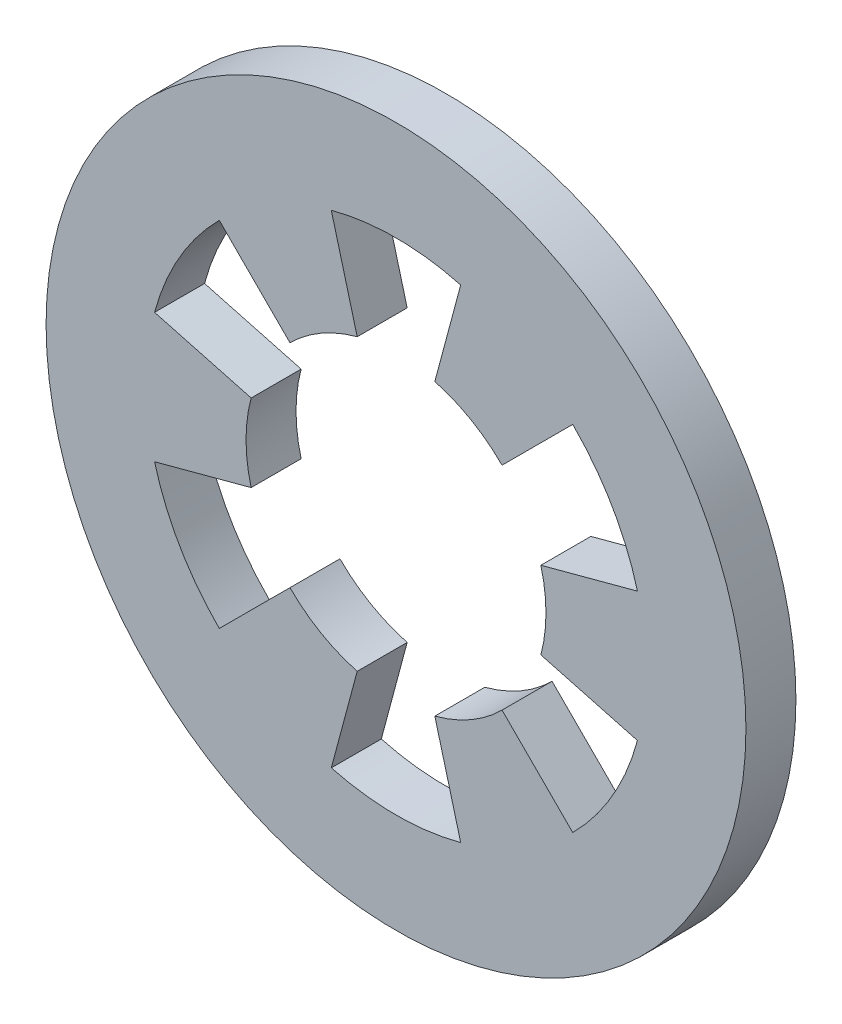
ISO-10303-21;
HEADER;
FILE_DESCRIPTION(('STEP AP214'),'2;1');
FILE_NAME('part.step','',(''),(''),'','','');
FILE_SCHEMA(('AUTOMOTIVE_DESIGN { 1 0 10303 214 1 1 1 1 }'));
ENDSEC;
DATA;
#1=APPLICATION_CONTEXT('core data for automotive mechanical design processes');
#2=APPLICATION_PROTOCOL_DEFINITION('international standard','automotive_design',2000,#1);
#3=PRODUCT_CONTEXT('',#1,'mechanical');
#4=PRODUCT('Part','Part','',(#3));
#5=PRODUCT_RELATED_PRODUCT_CATEGORY('part','',(#4));
#6=PRODUCT_DEFINITION_FORMATION('','',#4);
#7=PRODUCT_DEFINITION_CONTEXT('part definition',#1,'design');
#8=PRODUCT_DEFINITION('design','',#6,#7);
#9=PRODUCT_DEFINITION_SHAPE('','',#8);
#10=(LENGTH_UNIT() NAMED_UNIT(*) SI_UNIT(.MILLI.,.METRE.));
#11=(NAMED_UNIT(*) PLANE_ANGLE_UNIT() SI_UNIT($,.RADIAN.));
#12=(NAMED_UNIT(*) SI_UNIT($,.STERADIAN.) SOLID_ANGLE_UNIT());
#13=UNCERTAINTY_MEASURE_WITH_UNIT(LENGTH_MEASURE(1.E-05),#10,'distance_accuracy_value','');
#14=(GEOMETRIC_REPRESENTATION_CONTEXT(3) GLOBAL_UNCERTAINTY_ASSIGNED_CONTEXT((#13)) GLOBAL_UNIT_ASSIGNED_CONTEXT((#10,
#11,#12)) REPRESENTATION_CONTEXT('',''));
#15=CARTESIAN_POINT('',(0.,0.,0.));
#16=DIRECTION('',(0.,0.,1.));
#17=DIRECTION('',(1.,0.,0.));
#18=AXIS2_PLACEMENT_3D('',#15,#16,#17);
#19=CARTESIAN_POINT('',(0.,0.,0.5));
#20=DIRECTION('',(0.,0.,-1.));
#21=DIRECTION('',(-1.,0.,0.));
#22=AXIS2_PLACEMENT_3D('',#19,#20,#21);
#23=CYLINDRICAL_SURFACE('',#22,1.5);
#24=DIRECTION('',(0.,0.,1.));
#25=VECTOR('',#24,1.);
#26=CARTESIAN_POINT('',(0.3882285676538,1.4488887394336,0.));
#27=LINE('',#26,#25);
#28=CARTESIAN_POINT('',(0.3882285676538,1.4488887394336,0.));
#29=VERTEX_POINT('',#28);
#30=CARTESIAN_POINT('',(0.3882285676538,1.4488887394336,0.5));
#31=VERTEX_POINT('',#30);
#32=EDGE_CURVE('E225',#29,#31,#27,.T.);
#33=ORIENTED_EDGE('',*,*,#32,.F.);
#34=CARTESIAN_POINT('',(0.,0.,0.));
#35=DIRECTION('',(0.,0.,1.));
#36=DIRECTION('',(1.,0.,0.));
#37=AXIS2_PLACEMENT_3D('',#34,#35,#36);
#38=CIRCLE('',#37,1.5);
#39=CARTESIAN_POINT('',(1.06066017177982,1.06066017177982,0.));
#40=VERTEX_POINT('',#39);
#41=EDGE_CURVE('E360',#40,#29,#38,.T.);
#42=ORIENTED_EDGE('',*,*,#41,.F.);
#43=DIRECTION('',(0.,0.,1.));
#44=VECTOR('',#43,1.);
#45=CARTESIAN_POINT('',(1.06066017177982,1.06066017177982,0.));
#46=LINE('',#45,#44);
#47=CARTESIAN_POINT('',(1.06066017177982,1.06066017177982,0.5));
#48=VERTEX_POINT('',#47);
#49=EDGE_CURVE('E356',#40,#48,#46,.T.);
#50=ORIENTED_EDGE('',*,*,#49,.T.);
#51=CARTESIAN_POINT('',(0.,0.,0.5));
#52=DIRECTION('',(0.,0.,1.));
#53=DIRECTION('',(1.,0.,0.));
#54=AXIS2_PLACEMENT_3D('',#51,#52,#53);
#55=CIRCLE('',#54,1.5);
#56=EDGE_CURVE('E365',#48,#31,#55,.T.);
#57=ORIENTED_EDGE('',*,*,#56,.T.);
#58=EDGE_LOOP('',(#33,#42,#50,#57));
#59=FACE_BOUND('',#58,.T.);
#60=ADVANCED_FACE('F30',(#59),#23,.F.);
#61=DIRECTION('',(0.,0.,1.));
#62=VECTOR('',#61,1.);
#63=CARTESIAN_POINT('',(-0.388228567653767,1.44888873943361,0.));
#64=LINE('',#63,#62);
#65=CARTESIAN_POINT('',(-0.388228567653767,1.44888873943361,0.));
#66=VERTEX_POINT('',#65);
#67=CARTESIAN_POINT('',(-0.388228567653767,1.44888873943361,0.5));
#68=VERTEX_POINT('',#67);
#69=EDGE_CURVE('E45',#66,#68,#64,.T.);
#70=ORIENTED_EDGE('',*,*,#69,.T.);
#71=CARTESIAN_POINT('',(-1.06066017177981,1.06066017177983,0.5));
#72=VERTEX_POINT('',#71);
#73=EDGE_CURVE('E213',#68,#72,#55,.T.);
#74=ORIENTED_EDGE('',*,*,#73,.T.);
#75=DIRECTION('',(0.,0.,1.));
#76=VECTOR('',#75,1.);
#77=CARTESIAN_POINT('',(-1.06066017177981,1.06066017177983,0.));
#78=LINE('',#77,#76);
#79=CARTESIAN_POINT('',(-1.06066017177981,1.06066017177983,0.));
#80=VERTEX_POINT('',#79);
#81=EDGE_CURVE('E247',#80,#72,#78,.T.);
#82=ORIENTED_EDGE('',*,*,#81,.F.);
#83=EDGE_CURVE('E364',#66,#80,#38,.T.);
#84=ORIENTED_EDGE('',*,*,#83,.F.);
#85=EDGE_LOOP('',(#70,#74,#82,#84));
#86=FACE_BOUND('',#85,.T.);
#87=ADVANCED_FACE('F412',(#86),#23,.F.);
#88=DIRECTION('',(0.,0.,1.));
#89=VECTOR('',#88,1.);
#90=CARTESIAN_POINT('',(-1.4488887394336,0.388228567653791,0.));
#91=LINE('',#90,#89);
#92=CARTESIAN_POINT('',(-1.4488887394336,0.388228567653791,0.));
#93=VERTEX_POINT('',#92);
#94=CARTESIAN_POINT('',(-1.4488887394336,0.388228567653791,0.5));
#95=VERTEX_POINT('',#94);
#96=EDGE_CURVE('E53',#93,#95,#91,.T.);
#97=ORIENTED_EDGE('',*,*,#96,.T.);
#98=CARTESIAN_POINT('',(-1.44888873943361,-0.388228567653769,0.5));
#99=VERTEX_POINT('',#98);
#100=EDGE_CURVE('E403',#95,#99,#55,.T.);
#101=ORIENTED_EDGE('',*,*,#100,.T.);
#102=DIRECTION('',(0.,0.,1.));
#103=VECTOR('',#102,1.);
#104=CARTESIAN_POINT('',(-1.44888873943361,-0.388228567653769,0.));
#105=LINE('',#104,#103);
#106=CARTESIAN_POINT('',(-1.44888873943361,-0.388228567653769,0.));
#107=VERTEX_POINT('',#106);
#108=EDGE_CURVE('E272',#107,#99,#105,.T.);
#109=ORIENTED_EDGE('',*,*,#108,.F.);
#110=EDGE_CURVE('E422',#93,#107,#38,.T.);
#111=ORIENTED_EDGE('',*,*,#110,.F.);
#112=EDGE_LOOP('',(#97,#101,#109,#111));
#113=FACE_BOUND('',#112,.T.);
#114=ADVANCED_FACE('F450',(#113),#23,.F.);
#115=DIRECTION('',(0.,0.,1.));
#116=VECTOR('',#115,1.);
#117=CARTESIAN_POINT('',(-1.06066017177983,-1.06066017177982,0.));
#118=LINE('',#117,#116);
#119=CARTESIAN_POINT('',(-1.06066017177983,-1.06066017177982,0.));
#120=VERTEX_POINT('',#119);
#121=CARTESIAN_POINT('',(-1.06066017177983,-1.06066017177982,0.5));
#122=VERTEX_POINT('',#121);
#123=EDGE_CURVE('E275',#120,#122,#118,.T.);
#124=ORIENTED_EDGE('',*,*,#123,.T.);
#125=CARTESIAN_POINT('',(-0.38822856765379,-1.4488887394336,0.5));
#126=VERTEX_POINT('',#125);
#127=EDGE_CURVE('E399',#122,#126,#55,.T.);
#128=ORIENTED_EDGE('',*,*,#127,.T.);
#129=DIRECTION('',(0.,0.,1.));
#130=VECTOR('',#129,1.);
#131=CARTESIAN_POINT('',(-0.38822856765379,-1.4488887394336,0.));
#132=LINE('',#131,#130);
#133=CARTESIAN_POINT('',(-0.38822856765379,-1.4488887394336,0.));
#134=VERTEX_POINT('',#133);
#135=EDGE_CURVE('E299',#134,#126,#132,.T.);
#136=ORIENTED_EDGE('',*,*,#135,.F.);
#137=EDGE_CURVE('E423',#120,#134,#38,.T.);
#138=ORIENTED_EDGE('',*,*,#137,.F.);
#139=EDGE_LOOP('',(#124,#128,#136,#138));
#140=FACE_BOUND('',#139,.T.);
#141=ADVANCED_FACE('F445',(#140),#23,.F.);
#142=DIRECTION('',(0.,0.,1.));
#143=VECTOR('',#142,1.);
#144=CARTESIAN_POINT('',(0.388228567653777,-1.4488887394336,0.));
#145=LINE('',#144,#143);
#146=CARTESIAN_POINT('',(0.388228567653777,-1.4488887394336,0.));
#147=VERTEX_POINT('',#146);
#148=CARTESIAN_POINT('',(0.388228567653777,-1.4488887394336,0.5));
#149=VERTEX_POINT('',#148);
#150=EDGE_CURVE('E302',#147,#149,#145,.T.);
#151=ORIENTED_EDGE('',*,*,#150,.T.);
#152=CARTESIAN_POINT('',(1.06066017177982,-1.06066017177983,0.5));
#153=VERTEX_POINT('',#152);
#154=EDGE_CURVE('E398',#149,#153,#55,.T.);
#155=ORIENTED_EDGE('',*,*,#154,.T.);
#156=DIRECTION('',(0.,0.,1.));
#157=VECTOR('',#156,1.);
#158=CARTESIAN_POINT('',(1.06066017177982,-1.06066017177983,0.));
#159=LINE('',#158,#157);
#160=CARTESIAN_POINT('',(1.06066017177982,-1.06066017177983,0.));
#161=VERTEX_POINT('',#160);
#162=EDGE_CURVE('E326',#161,#153,#159,.T.);
#163=ORIENTED_EDGE('',*,*,#162,.F.);
#164=EDGE_CURVE('E426',#147,#161,#38,.T.);
#165=ORIENTED_EDGE('',*,*,#164,.F.);
#166=EDGE_LOOP('',(#151,#155,#163,#165));
#167=FACE_BOUND('',#166,.T.);
#168=ADVANCED_FACE('F436',(#167),#23,.F.);
#169=CARTESIAN_POINT('',(0.,0.,0.5));
#170=DIRECTION('',(0.,0.,1.));
#171=DIRECTION('',(1.,0.,0.));
#172=AXIS2_PLACEMENT_3D('',#169,#170,#171);
#173=PLANE('',#172);
#174=DIRECTION('',(0.258819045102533,0.965925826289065,0.));
#175=VECTOR('',#174,1.);
#176=CARTESIAN_POINT('',(0.3882285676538,1.4488887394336,0.5));
#177=LINE('',#176,#175);
#178=CARTESIAN_POINT('',(0.647047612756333,2.41481456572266,0.5));
#179=VERTEX_POINT('',#178);
#180=EDGE_CURVE('E214',#31,#179,#177,.T.);
#181=ORIENTED_EDGE('',*,*,#180,.F.);
#182=ORIENTED_EDGE('',*,*,#56,.F.);
#183=DIRECTION('',(-0.707106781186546,-0.707106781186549,0.));
#184=VECTOR('',#183,1.);
#185=CARTESIAN_POINT('',(1.06066017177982,1.06066017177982,0.5));
#186=LINE('',#185,#184);
#187=CARTESIAN_POINT('',(1.76776695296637,1.76776695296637,0.5));
#188=VERTEX_POINT('',#187);
#189=EDGE_CURVE('E335',#188,#48,#186,.T.);
#190=ORIENTED_EDGE('',*,*,#189,.F.);
#191=CARTESIAN_POINT('',(0.,0.,0.5));
#192=DIRECTION('',(0.,0.,1.));
#193=DIRECTION('',(1.,0.,0.));
#194=AXIS2_PLACEMENT_3D('',#191,#192,#193);
#195=CIRCLE('',#194,2.5);
#196=CARTESIAN_POINT('',(2.41481456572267,0.647047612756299,0.5));
#197=VERTEX_POINT('',#196);
#198=EDGE_CURVE('E325',#197,#188,#195,.T.);
#199=ORIENTED_EDGE('',*,*,#198,.F.);
#200=DIRECTION('',(0.965925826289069,0.25881904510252,0.));
#201=VECTOR('',#200,1.);
#202=CARTESIAN_POINT('',(1.4488887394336,0.388228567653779,0.5));
#203=LINE('',#202,#201);
#204=CARTESIAN_POINT('',(1.4488887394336,0.388228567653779,0.5));
#205=VERTEX_POINT('',#204);
#206=EDGE_CURVE('E337',#205,#197,#203,.T.);
#207=ORIENTED_EDGE('',*,*,#206,.F.);
#208=CARTESIAN_POINT('',(1.4488887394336,-0.388228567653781,0.5));
#209=VERTEX_POINT('',#208);
#210=EDGE_CURVE('E363',#209,#205,#55,.T.);
#211=ORIENTED_EDGE('',*,*,#210,.F.);
#212=DIRECTION('',(-0.965925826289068,0.258819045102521,0.));
#213=VECTOR('',#212,1.);
#214=CARTESIAN_POINT('',(1.4488887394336,-0.388228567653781,0.5));
#215=LINE('',#214,#213);
#216=CARTESIAN_POINT('',(2.41481456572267,-0.647047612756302,0.5));
#217=VERTEX_POINT('',#216);
#218=EDGE_CURVE('E308',#217,#209,#215,.T.);
#219=ORIENTED_EDGE('',*,*,#218,.F.);
#220=CARTESIAN_POINT('',(0.,0.,0.5));
#221=DIRECTION('',(0.,0.,1.));
#222=DIRECTION('',(0.499999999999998,-0.86602540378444,0.));
#223=AXIS2_PLACEMENT_3D('',#220,#221,#222);
#224=CIRCLE('',#223,2.5);
#225=CARTESIAN_POINT('',(1.76776695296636,-1.76776695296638,0.5));
#226=VERTEX_POINT('',#225);
#227=EDGE_CURVE('E298',#226,#217,#224,.T.);
#228=ORIENTED_EDGE('',*,*,#227,.F.);
#229=DIRECTION('',(0.707106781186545,-0.70710678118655,0.));
#230=VECTOR('',#229,1.);
#231=CARTESIAN_POINT('',(1.06066017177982,-1.06066017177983,0.5));
#232=LINE('',#231,#230);
#233=EDGE_CURVE('E310',#153,#226,#232,.T.);
#234=ORIENTED_EDGE('',*,*,#233,.F.);
#235=ORIENTED_EDGE('',*,*,#154,.F.);
#236=DIRECTION('',(-0.258819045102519,0.965925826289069,0.));
#237=VECTOR('',#236,1.);
#238=CARTESIAN_POINT('',(0.388228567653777,-1.4488887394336,0.5));
#239=LINE('',#238,#237);
#240=CARTESIAN_POINT('',(0.647047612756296,-2.41481456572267,0.5));
#241=VERTEX_POINT('',#240);
#242=EDGE_CURVE('E281',#241,#149,#239,.T.);
#243=ORIENTED_EDGE('',*,*,#242,.F.);
#244=CARTESIAN_POINT('',(0.,0.,0.5));
#245=DIRECTION('',(0.,0.,1.));
#246=DIRECTION('',(-0.500000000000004,-0.866025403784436,0.));
#247=AXIS2_PLACEMENT_3D('',#244,#245,#246);
#248=CIRCLE('',#247,2.5);
#249=CARTESIAN_POINT('',(-0.647047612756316,-2.41481456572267,0.5));
#250=VERTEX_POINT('',#249);
#251=EDGE_CURVE('E271',#250,#241,#248,.T.);
#252=ORIENTED_EDGE('',*,*,#251,.F.);
#253=DIRECTION('',(-0.258819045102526,-0.965925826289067,0.));
#254=VECTOR('',#253,1.);
#255=CARTESIAN_POINT('',(-0.38822856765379,-1.4488887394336,0.5));
#256=LINE('',#255,#254);
#257=EDGE_CURVE('E283',#126,#250,#256,.T.);
#258=ORIENTED_EDGE('',*,*,#257,.F.);
#259=ORIENTED_EDGE('',*,*,#127,.F.);
#260=DIRECTION('',(0.707106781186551,0.707106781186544,0.));
#261=VECTOR('',#260,1.);
#262=CARTESIAN_POINT('',(-1.06066017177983,-1.06066017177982,0.5));
#263=LINE('',#262,#261);
#264=CARTESIAN_POINT('',(-1.76776695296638,-1.76776695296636,0.5));
#265=VERTEX_POINT('',#264);
#266=EDGE_CURVE('E254',#265,#122,#263,.T.);
#267=ORIENTED_EDGE('',*,*,#266,.F.);
#268=CARTESIAN_POINT('',(0.,0.,0.5));
#269=DIRECTION('',(0.,0.,1.));
#270=DIRECTION('',(-1.,0.,0.));
#271=AXIS2_PLACEMENT_3D('',#268,#269,#270);
#272=CIRCLE('',#271,2.5);
#273=CARTESIAN_POINT('',(-2.41481456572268,-0.647047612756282,0.5));
#274=VERTEX_POINT('',#273);
#275=EDGE_CURVE('E246',#274,#265,#272,.T.);
#276=ORIENTED_EDGE('',*,*,#275,.F.);
#277=DIRECTION('',(-0.96592582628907,-0.258819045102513,0.));
#278=VECTOR('',#277,1.);
#279=CARTESIAN_POINT('',(-1.44888873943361,-0.388228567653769,0.5));
#280=LINE('',#279,#278);
#281=EDGE_CURVE('E256',#99,#274,#280,.T.);
#282=ORIENTED_EDGE('',*,*,#281,.F.);
#283=ORIENTED_EDGE('',*,*,#100,.F.);
#284=DIRECTION('',(0.965925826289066,-0.258819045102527,0.));
#285=VECTOR('',#284,1.);
#286=CARTESIAN_POINT('',(-1.4488887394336,0.388228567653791,0.5));
#287=LINE('',#286,#285);
#288=CARTESIAN_POINT('',(-2.41481456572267,0.647047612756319,0.5));
#289=VERTEX_POINT('',#288);
#290=EDGE_CURVE('E230',#289,#95,#287,.T.);
#291=ORIENTED_EDGE('',*,*,#290,.F.);
#292=CARTESIAN_POINT('',(0.,0.,0.5));
#293=DIRECTION('',(0.,0.,1.));
#294=DIRECTION('',(-0.499999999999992,0.866025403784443,0.));
#295=AXIS2_PLACEMENT_3D('',#292,#293,#294);
#296=CIRCLE('',#295,2.5);
#297=CARTESIAN_POINT('',(-1.76776695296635,1.76776695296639,0.5));
#298=VERTEX_POINT('',#297);
#299=EDGE_CURVE('E224',#298,#289,#296,.T.);
#300=ORIENTED_EDGE('',*,*,#299,.F.);
#301=DIRECTION('',(-0.70710678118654,0.707106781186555,0.));
#302=VECTOR('',#301,1.);
#303=CARTESIAN_POINT('',(-1.06066017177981,1.06066017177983,0.5));
#304=LINE('',#303,#302);
#305=EDGE_CURVE('E232',#72,#298,#304,.T.);
#306=ORIENTED_EDGE('',*,*,#305,.F.);
#307=ORIENTED_EDGE('',*,*,#73,.F.);
#308=DIRECTION('',(0.258819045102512,-0.965925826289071,0.));
#309=VECTOR('',#308,1.);
#310=CARTESIAN_POINT('',(-0.388228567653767,1.44888873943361,0.5));
#311=LINE('',#310,#309);
#312=CARTESIAN_POINT('',(-0.647047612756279,2.41481456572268,0.5));
#313=VERTEX_POINT('',#312);
#314=EDGE_CURVE('E194',#313,#68,#311,.T.);
#315=ORIENTED_EDGE('',*,*,#314,.F.);
#316=CARTESIAN_POINT('',(0.,0.,0.5));
#317=DIRECTION('',(0.,0.,1.));
#318=DIRECTION('',(0.50000000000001,0.866025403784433,0.));
#319=AXIS2_PLACEMENT_3D('',#316,#317,#318);
#320=CIRCLE('',#319,2.5);
#321=EDGE_CURVE('E202',#179,#313,#320,.T.);
#322=ORIENTED_EDGE('',*,*,#321,.F.);
#323=EDGE_LOOP('',(#181,#182,#190,#199,#207,#211,#219,#228,#234,#235,#243,#252,#258,#259,#267,
#276,#282,#283,#291,#300,#306,#307,#315,#322));
#324=FACE_BOUND('',#323,.T.);
#325=CARTESIAN_POINT('',(0.,0.,0.5));
#326=DIRECTION('',(0.,0.,1.));
#327=DIRECTION('',(1.,0.,0.));
#328=AXIS2_PLACEMENT_3D('',#325,#326,#327);
#329=CIRCLE('',#328,3.5);
#330=CARTESIAN_POINT('',(3.5,0.,0.5));
#331=VERTEX_POINT('',#330);
#332=EDGE_CURVE('E11',#331,#331,#329,.T.);
#333=ORIENTED_EDGE('',*,*,#332,.T.);
#334=EDGE_LOOP('',(#333));
#335=FACE_BOUND('',#334,.T.);
#336=ADVANCED_FACE('F210',(#324,#335),#173,.T.);
#337=CARTESIAN_POINT('',(0.,0.,0.));
#338=DIRECTION('',(0.,0.,1.));
#339=DIRECTION('',(1.,0.,0.));
#340=AXIS2_PLACEMENT_3D('',#337,#338,#339);
#341=PLANE('',#340);
#342=CARTESIAN_POINT('',(0.,0.,0.));
#343=DIRECTION('',(0.,0.,1.));
#344=DIRECTION('',(1.,0.,0.));
#345=AXIS2_PLACEMENT_3D('',#342,#343,#344);
#346=CIRCLE('',#345,3.5);
#347=CARTESIAN_POINT('',(3.5,0.,0.));
#348=VERTEX_POINT('',#347);
#349=EDGE_CURVE('E38',#348,#348,#346,.T.);
#350=ORIENTED_EDGE('',*,*,#349,.F.);
#351=EDGE_LOOP('',(#350));
#352=FACE_BOUND('',#351,.T.);
#353=ORIENTED_EDGE('',*,*,#41,.T.);
#354=DIRECTION('',(0.258819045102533,0.965925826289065,0.));
#355=VECTOR('',#354,1.);
#356=CARTESIAN_POINT('',(0.3882285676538,1.4488887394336,0.));
#357=LINE('',#356,#355);
#358=CARTESIAN_POINT('',(0.647047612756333,2.41481456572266,0.));
#359=VERTEX_POINT('',#358);
#360=EDGE_CURVE('E199',#29,#359,#357,.T.);
#361=ORIENTED_EDGE('',*,*,#360,.T.);
#362=CARTESIAN_POINT('',(0.,0.,0.));
#363=DIRECTION('',(0.,0.,1.));
#364=DIRECTION('',(0.50000000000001,0.866025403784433,0.));
#365=AXIS2_PLACEMENT_3D('',#362,#363,#364);
#366=CIRCLE('',#365,2.5);
#367=CARTESIAN_POINT('',(-0.647047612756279,2.41481456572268,0.));
#368=VERTEX_POINT('',#367);
#369=EDGE_CURVE('E216',#359,#368,#366,.T.);
#370=ORIENTED_EDGE('',*,*,#369,.T.);
#371=DIRECTION('',(0.258819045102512,-0.965925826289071,0.));
#372=VECTOR('',#371,1.);
#373=CARTESIAN_POINT('',(-0.388228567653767,1.44888873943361,0.));
#374=LINE('',#373,#372);
#375=EDGE_CURVE('E195',#368,#66,#374,.T.);
#376=ORIENTED_EDGE('',*,*,#375,.T.);
#377=ORIENTED_EDGE('',*,*,#83,.T.);
#378=DIRECTION('',(-0.70710678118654,0.707106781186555,0.));
#379=VECTOR('',#378,1.);
#380=CARTESIAN_POINT('',(-1.06066017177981,1.06066017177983,0.));
#381=LINE('',#380,#379);
#382=CARTESIAN_POINT('',(-1.76776695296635,1.76776695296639,0.));
#383=VERTEX_POINT('',#382);
#384=EDGE_CURVE('E240',#80,#383,#381,.T.);
#385=ORIENTED_EDGE('',*,*,#384,.T.);
#386=CARTESIAN_POINT('',(0.,0.,0.));
#387=DIRECTION('',(0.,0.,1.));
#388=DIRECTION('',(-0.499999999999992,0.866025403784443,0.));
#389=AXIS2_PLACEMENT_3D('',#386,#387,#388);
#390=CIRCLE('',#389,2.5);
#391=CARTESIAN_POINT('',(-2.41481456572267,0.647047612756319,0.));
#392=VERTEX_POINT('',#391);
#393=EDGE_CURVE('E235',#383,#392,#390,.T.);
#394=ORIENTED_EDGE('',*,*,#393,.T.);
#395=DIRECTION('',(0.965925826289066,-0.258819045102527,0.));
#396=VECTOR('',#395,1.);
#397=CARTESIAN_POINT('',(-1.4488887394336,0.388228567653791,0.));
#398=LINE('',#397,#396);
#399=EDGE_CURVE('E238',#392,#93,#398,.T.);
#400=ORIENTED_EDGE('',*,*,#399,.T.);
#401=ORIENTED_EDGE('',*,*,#110,.T.);
#402=DIRECTION('',(-0.96592582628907,-0.258819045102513,0.));
#403=VECTOR('',#402,1.);
#404=CARTESIAN_POINT('',(-1.44888873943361,-0.388228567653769,0.));
#405=LINE('',#404,#403);
#406=CARTESIAN_POINT('',(-2.41481456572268,-0.647047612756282,0.));
#407=VERTEX_POINT('',#406);
#408=EDGE_CURVE('E265',#107,#407,#405,.T.);
#409=ORIENTED_EDGE('',*,*,#408,.T.);
#410=CARTESIAN_POINT('',(0.,0.,0.));
#411=DIRECTION('',(0.,0.,1.));
#412=DIRECTION('',(-1.,0.,0.));
#413=AXIS2_PLACEMENT_3D('',#410,#411,#412);
#414=CIRCLE('',#413,2.5);
#415=CARTESIAN_POINT('',(-1.76776695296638,-1.76776695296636,0.));
#416=VERTEX_POINT('',#415);
#417=EDGE_CURVE('E259',#407,#416,#414,.T.);
#418=ORIENTED_EDGE('',*,*,#417,.T.);
#419=DIRECTION('',(0.707106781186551,0.707106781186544,0.));
#420=VECTOR('',#419,1.);
#421=CARTESIAN_POINT('',(-1.06066017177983,-1.06066017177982,0.));
#422=LINE('',#421,#420);
#423=EDGE_CURVE('E262',#416,#120,#422,.T.);
#424=ORIENTED_EDGE('',*,*,#423,.T.);
#425=ORIENTED_EDGE('',*,*,#137,.T.);
#426=DIRECTION('',(-0.258819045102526,-0.965925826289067,0.));
#427=VECTOR('',#426,1.);
#428=CARTESIAN_POINT('',(-0.38822856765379,-1.4488887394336,0.));
#429=LINE('',#428,#427);
#430=CARTESIAN_POINT('',(-0.647047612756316,-2.41481456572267,0.));
#431=VERTEX_POINT('',#430);
#432=EDGE_CURVE('E292',#134,#431,#429,.T.);
#433=ORIENTED_EDGE('',*,*,#432,.T.);
#434=CARTESIAN_POINT('',(0.,0.,0.));
#435=DIRECTION('',(0.,0.,1.));
#436=DIRECTION('',(-0.500000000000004,-0.866025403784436,0.));
#437=AXIS2_PLACEMENT_3D('',#434,#435,#436);
#438=CIRCLE('',#437,2.5);
#439=CARTESIAN_POINT('',(0.647047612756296,-2.41481456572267,0.));
#440=VERTEX_POINT('',#439);
#441=EDGE_CURVE('E286',#431,#440,#438,.T.);
#442=ORIENTED_EDGE('',*,*,#441,.T.);
#443=DIRECTION('',(-0.258819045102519,0.965925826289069,0.));
#444=VECTOR('',#443,1.);
#445=CARTESIAN_POINT('',(0.388228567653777,-1.4488887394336,0.));
#446=LINE('',#445,#444);
#447=EDGE_CURVE('E289',#440,#147,#446,.T.);
#448=ORIENTED_EDGE('',*,*,#447,.T.);
#449=ORIENTED_EDGE('',*,*,#164,.T.);
#450=DIRECTION('',(0.707106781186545,-0.70710678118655,0.));
#451=VECTOR('',#450,1.);
#452=CARTESIAN_POINT('',(1.06066017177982,-1.06066017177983,0.));
#453=LINE('',#452,#451);
#454=CARTESIAN_POINT('',(1.76776695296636,-1.76776695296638,0.));
#455=VERTEX_POINT('',#454);
#456=EDGE_CURVE('E319',#161,#455,#453,.T.);
#457=ORIENTED_EDGE('',*,*,#456,.T.);
#458=CARTESIAN_POINT('',(0.,0.,0.));
#459=DIRECTION('',(0.,0.,1.));
#460=DIRECTION('',(0.499999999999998,-0.86602540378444,0.));
#461=AXIS2_PLACEMENT_3D('',#458,#459,#460);
#462=CIRCLE('',#461,2.5);
#463=CARTESIAN_POINT('',(2.41481456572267,-0.647047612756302,0.));
#464=VERTEX_POINT('',#463);
#465=EDGE_CURVE('E313',#455,#464,#462,.T.);
#466=ORIENTED_EDGE('',*,*,#465,.T.);
#467=DIRECTION('',(-0.965925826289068,0.258819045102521,0.));
#468=VECTOR('',#467,1.);
#469=CARTESIAN_POINT('',(1.4488887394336,-0.388228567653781,0.));
#470=LINE('',#469,#468);
#471=CARTESIAN_POINT('',(1.4488887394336,-0.388228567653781,0.));
#472=VERTEX_POINT('',#471);
#473=EDGE_CURVE('E316',#464,#472,#470,.T.);
#474=ORIENTED_EDGE('',*,*,#473,.T.);
#475=CARTESIAN_POINT('',(1.4488887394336,0.388228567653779,0.));
#476=VERTEX_POINT('',#475);
#477=EDGE_CURVE('E352',#472,#476,#38,.T.);
#478=ORIENTED_EDGE('',*,*,#477,.T.);
#479=DIRECTION('',(0.965925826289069,0.25881904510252,0.));
#480=VECTOR('',#479,1.);
#481=CARTESIAN_POINT('',(1.4488887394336,0.388228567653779,0.));
#482=LINE('',#481,#480);
#483=CARTESIAN_POINT('',(2.41481456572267,0.647047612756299,0.));
#484=VERTEX_POINT('',#483);
#485=EDGE_CURVE('E346',#476,#484,#482,.T.);
#486=ORIENTED_EDGE('',*,*,#485,.T.);
#487=CARTESIAN_POINT('',(0.,0.,0.));
#488=DIRECTION('',(0.,0.,1.));
#489=DIRECTION('',(1.,0.,0.));
#490=AXIS2_PLACEMENT_3D('',#487,#488,#489);
#491=CIRCLE('',#490,2.5);
#492=CARTESIAN_POINT('',(1.76776695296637,1.76776695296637,0.));
#493=VERTEX_POINT('',#492);
#494=EDGE_CURVE('E340',#484,#493,#491,.T.);
#495=ORIENTED_EDGE('',*,*,#494,.T.);
#496=DIRECTION('',(-0.707106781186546,-0.707106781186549,0.));
#497=VECTOR('',#496,1.);
#498=CARTESIAN_POINT('',(1.06066017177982,1.06066017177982,0.));
#499=LINE('',#498,#497);
#500=EDGE_CURVE('E343',#493,#40,#499,.T.);
#501=ORIENTED_EDGE('',*,*,#500,.T.);
#502=EDGE_LOOP('',(#353,#361,#370,#376,#377,#385,#394,#400,#401,#409,#418,#424,#425,#433,#442,
#448,#449,#457,#466,#474,#478,#486,#495,#501));
#503=FACE_BOUND('',#502,.T.);
#504=ADVANCED_FACE('F371',(#352,#503),#341,.F.);
#505=CARTESIAN_POINT('',(0.,0.,0.5));
#506=DIRECTION('',(0.,0.,-1.));
#507=DIRECTION('',(-1.,0.,0.));
#508=AXIS2_PLACEMENT_3D('',#505,#506,#507);
#509=CYLINDRICAL_SURFACE('',#508,3.5);
#510=ORIENTED_EDGE('',*,*,#332,.F.);
#511=EDGE_LOOP('',(#510));
#512=FACE_BOUND('',#511,.T.);
#513=ORIENTED_EDGE('',*,*,#349,.T.);
#514=EDGE_LOOP('',(#513));
#515=FACE_BOUND('',#514,.T.);
#516=ADVANCED_FACE('F32',(#512,#515),#509,.T.);
#517=DIRECTION('',(0.,0.,1.));
#518=VECTOR('',#517,1.);
#519=CARTESIAN_POINT('',(1.4488887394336,-0.388228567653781,0.));
#520=LINE('',#519,#518);
#521=EDGE_CURVE('E329',#472,#209,#520,.T.);
#522=ORIENTED_EDGE('',*,*,#521,.T.);
#523=ORIENTED_EDGE('',*,*,#210,.T.);
#524=DIRECTION('',(0.,0.,1.));
#525=VECTOR('',#524,1.);
#526=CARTESIAN_POINT('',(1.4488887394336,0.388228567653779,0.));
#527=LINE('',#526,#525);
#528=EDGE_CURVE('E353',#476,#205,#527,.T.);
#529=ORIENTED_EDGE('',*,*,#528,.F.);
#530=ORIENTED_EDGE('',*,*,#477,.F.);
#531=EDGE_LOOP('',(#522,#523,#529,#530));
#532=FACE_BOUND('',#531,.T.);
#533=ADVANCED_FACE('F433',(#532),#23,.F.);
#534=CARTESIAN_POINT('',(0.,0.,0.));
#535=DIRECTION('',(0.,0.,1.));
#536=DIRECTION('',(1.,0.,0.));
#537=AXIS2_PLACEMENT_3D('',#534,#535,#536);
#538=CYLINDRICAL_SURFACE('',#537,2.5);
#539=ORIENTED_EDGE('',*,*,#198,.T.);
#540=DIRECTION('',(0.,0.,1.));
#541=VECTOR('',#540,1.);
#542=CARTESIAN_POINT('',(1.76776695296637,1.76776695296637,0.));
#543=LINE('',#542,#541);
#544=EDGE_CURVE('E349',#493,#188,#543,.T.);
#545=ORIENTED_EDGE('',*,*,#544,.F.);
#546=ORIENTED_EDGE('',*,*,#494,.F.);
#547=DIRECTION('',(0.,0.,1.));
#548=VECTOR('',#547,1.);
#549=CARTESIAN_POINT('',(2.41481456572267,0.647047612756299,0.));
#550=LINE('',#549,#548);
#551=EDGE_CURVE('E350',#484,#197,#550,.T.);
#552=ORIENTED_EDGE('',*,*,#551,.T.);
#553=EDGE_LOOP('',(#539,#545,#546,#552));
#554=FACE_BOUND('',#553,.T.);
#555=ADVANCED_FACE('F389',(#554),#538,.F.);
#556=CARTESIAN_POINT('',(1.4488887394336,0.388228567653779,0.));
#557=DIRECTION('',(0.25881904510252,-0.965925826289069,0.));
#558=DIRECTION('',(0.965925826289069,0.25881904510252,0.));
#559=AXIS2_PLACEMENT_3D('',#556,#557,#558);
#560=PLANE('',#559);
#561=ORIENTED_EDGE('',*,*,#206,.T.);
#562=ORIENTED_EDGE('',*,*,#551,.F.);
#563=ORIENTED_EDGE('',*,*,#485,.F.);
#564=ORIENTED_EDGE('',*,*,#528,.T.);
#565=EDGE_LOOP('',(#561,#562,#563,#564));
#566=FACE_BOUND('',#565,.T.);
#567=ADVANCED_FACE('F392',(#566),#560,.F.);
#568=CARTESIAN_POINT('',(1.06066017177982,1.06066017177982,0.));
#569=DIRECTION('',(-0.707106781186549,0.707106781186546,0.));
#570=DIRECTION('',(-0.707106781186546,-0.707106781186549,0.));
#571=AXIS2_PLACEMENT_3D('',#568,#569,#570);
#572=PLANE('',#571);
#573=ORIENTED_EDGE('',*,*,#189,.T.);
#574=ORIENTED_EDGE('',*,*,#49,.F.);
#575=ORIENTED_EDGE('',*,*,#500,.F.);
#576=ORIENTED_EDGE('',*,*,#544,.T.);
#577=EDGE_LOOP('',(#573,#574,#575,#576));
#578=FACE_BOUND('',#577,.T.);
#579=ADVANCED_FACE('F386',(#578),#572,.F.);
#580=CARTESIAN_POINT('',(0.,0.,0.));
#581=DIRECTION('',(0.,0.,1.));
#582=DIRECTION('',(1.,0.,0.));
#583=AXIS2_PLACEMENT_3D('',#580,#581,#582);
#584=CYLINDRICAL_SURFACE('',#583,2.5);
#585=ORIENTED_EDGE('',*,*,#227,.T.);
#586=DIRECTION('',(0.,0.,1.));
#587=VECTOR('',#586,1.);
#588=CARTESIAN_POINT('',(2.41481456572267,-0.647047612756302,0.));
#589=LINE('',#588,#587);
#590=EDGE_CURVE('E322',#464,#217,#589,.T.);
#591=ORIENTED_EDGE('',*,*,#590,.F.);
#592=ORIENTED_EDGE('',*,*,#465,.F.);
#593=DIRECTION('',(0.,0.,1.));
#594=VECTOR('',#593,1.);
#595=CARTESIAN_POINT('',(1.76776695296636,-1.76776695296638,0.));
#596=LINE('',#595,#594);
#597=EDGE_CURVE('E323',#455,#226,#596,.T.);
#598=ORIENTED_EDGE('',*,*,#597,.T.);
#599=EDGE_LOOP('',(#585,#591,#592,#598));
#600=FACE_BOUND('',#599,.T.);
#601=ADVANCED_FACE('F460',(#600),#584,.F.);
#602=CARTESIAN_POINT('',(1.06066017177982,-1.06066017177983,0.));
#603=DIRECTION('',(-0.70710678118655,-0.707106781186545,0.));
#604=DIRECTION('',(0.707106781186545,-0.70710678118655,0.));
#605=AXIS2_PLACEMENT_3D('',#602,#603,#604);
#606=PLANE('',#605);
#607=ORIENTED_EDGE('',*,*,#233,.T.);
#608=ORIENTED_EDGE('',*,*,#597,.F.);
#609=ORIENTED_EDGE('',*,*,#456,.F.);
#610=ORIENTED_EDGE('',*,*,#162,.T.);
#611=EDGE_LOOP('',(#607,#608,#609,#610));
#612=FACE_BOUND('',#611,.T.);
#613=ADVANCED_FACE('F457',(#612),#606,.F.);
#614=CARTESIAN_POINT('',(1.4488887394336,-0.388228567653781,0.));
#615=DIRECTION('',(0.258819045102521,0.965925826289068,0.));
#616=DIRECTION('',(-0.965925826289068,0.258819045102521,0.));
#617=AXIS2_PLACEMENT_3D('',#614,#615,#616);
#618=PLANE('',#617);
#619=ORIENTED_EDGE('',*,*,#218,.T.);
#620=ORIENTED_EDGE('',*,*,#521,.F.);
#621=ORIENTED_EDGE('',*,*,#473,.F.);
#622=ORIENTED_EDGE('',*,*,#590,.T.);
#623=EDGE_LOOP('',(#619,#620,#621,#622));
#624=FACE_BOUND('',#623,.T.);
#625=ADVANCED_FACE('F462',(#624),#618,.F.);
#626=CARTESIAN_POINT('',(0.,0.,0.));
#627=DIRECTION('',(0.,0.,1.));
#628=DIRECTION('',(1.,0.,0.));
#629=AXIS2_PLACEMENT_3D('',#626,#627,#628);
#630=CYLINDRICAL_SURFACE('',#629,2.5);
#631=ORIENTED_EDGE('',*,*,#251,.T.);
#632=DIRECTION('',(0.,0.,1.));
#633=VECTOR('',#632,1.);
#634=CARTESIAN_POINT('',(0.647047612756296,-2.41481456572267,0.));
#635=LINE('',#634,#633);
#636=EDGE_CURVE('E295',#440,#241,#635,.T.);
#637=ORIENTED_EDGE('',*,*,#636,.F.);
#638=ORIENTED_EDGE('',*,*,#441,.F.);
#639=DIRECTION('',(0.,0.,1.));
#640=VECTOR('',#639,1.);
#641=CARTESIAN_POINT('',(-0.647047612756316,-2.41481456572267,0.));
#642=LINE('',#641,#640);
#643=EDGE_CURVE('E296',#431,#250,#642,.T.);
#644=ORIENTED_EDGE('',*,*,#643,.T.);
#645=EDGE_LOOP('',(#631,#637,#638,#644));
#646=FACE_BOUND('',#645,.T.);
#647=ADVANCED_FACE('F464',(#646),#630,.F.);
#648=CARTESIAN_POINT('',(-0.38822856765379,-1.4488887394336,0.));
#649=DIRECTION('',(-0.965925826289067,0.258819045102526,0.));
#650=DIRECTION('',(-0.258819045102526,-0.965925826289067,0.));
#651=AXIS2_PLACEMENT_3D('',#648,#649,#650);
#652=PLANE('',#651);
#653=ORIENTED_EDGE('',*,*,#257,.T.);
#654=ORIENTED_EDGE('',*,*,#643,.F.);
#655=ORIENTED_EDGE('',*,*,#432,.F.);
#656=ORIENTED_EDGE('',*,*,#135,.T.);
#657=EDGE_LOOP('',(#653,#654,#655,#656));
#658=FACE_BOUND('',#657,.T.);
#659=ADVANCED_FACE('F470',(#658),#652,.F.);
#660=CARTESIAN_POINT('',(0.388228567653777,-1.4488887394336,0.));
#661=DIRECTION('',(0.965925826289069,0.258819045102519,0.));
#662=DIRECTION('',(-0.258819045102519,0.965925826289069,0.));
#663=AXIS2_PLACEMENT_3D('',#660,#661,#662);
#664=PLANE('',#663);
#665=ORIENTED_EDGE('',*,*,#242,.T.);
#666=ORIENTED_EDGE('',*,*,#150,.F.);
#667=ORIENTED_EDGE('',*,*,#447,.F.);
#668=ORIENTED_EDGE('',*,*,#636,.T.);
#669=EDGE_LOOP('',(#665,#666,#667,#668));
#670=FACE_BOUND('',#669,.T.);
#671=ADVANCED_FACE('F511',(#670),#664,.F.);
#672=CARTESIAN_POINT('',(0.,0.,0.));
#673=DIRECTION('',(0.,0.,1.));
#674=DIRECTION('',(1.,0.,0.));
#675=AXIS2_PLACEMENT_3D('',#672,#673,#674);
#676=CYLINDRICAL_SURFACE('',#675,2.5);
#677=ORIENTED_EDGE('',*,*,#275,.T.);
#678=DIRECTION('',(0.,0.,1.));
#679=VECTOR('',#678,1.);
#680=CARTESIAN_POINT('',(-1.76776695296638,-1.76776695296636,0.));
#681=LINE('',#680,#679);
#682=EDGE_CURVE('E268',#416,#265,#681,.T.);
#683=ORIENTED_EDGE('',*,*,#682,.F.);
#684=ORIENTED_EDGE('',*,*,#417,.F.);
#685=DIRECTION('',(0.,0.,1.));
#686=VECTOR('',#685,1.);
#687=CARTESIAN_POINT('',(-2.41481456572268,-0.647047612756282,0.));
#688=LINE('',#687,#686);
#689=EDGE_CURVE('E269',#407,#274,#688,.T.);
#690=ORIENTED_EDGE('',*,*,#689,.T.);
#691=EDGE_LOOP('',(#677,#683,#684,#690));
#692=FACE_BOUND('',#691,.T.);
#693=ADVANCED_FACE('F521',(#692),#676,.F.);
#694=CARTESIAN_POINT('',(-1.44888873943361,-0.388228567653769,0.));
#695=DIRECTION('',(-0.258819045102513,0.965925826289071,0.));
#696=DIRECTION('',(-0.965925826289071,-0.258819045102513,0.));
#697=AXIS2_PLACEMENT_3D('',#694,#695,#696);
#698=PLANE('',#697);
#699=ORIENTED_EDGE('',*,*,#281,.T.);
#700=ORIENTED_EDGE('',*,*,#689,.F.);
#701=ORIENTED_EDGE('',*,*,#408,.F.);
#702=ORIENTED_EDGE('',*,*,#108,.T.);
#703=EDGE_LOOP('',(#699,#700,#701,#702));
#704=FACE_BOUND('',#703,.T.);
#705=ADVANCED_FACE('F530',(#704),#698,.F.);
#706=CARTESIAN_POINT('',(-1.06066017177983,-1.06066017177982,0.));
#707=DIRECTION('',(0.707106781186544,-0.707106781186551,0.));
#708=DIRECTION('',(0.707106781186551,0.707106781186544,0.));
#709=AXIS2_PLACEMENT_3D('',#706,#707,#708);
#710=PLANE('',#709);
#711=ORIENTED_EDGE('',*,*,#266,.T.);
#712=ORIENTED_EDGE('',*,*,#123,.F.);
#713=ORIENTED_EDGE('',*,*,#423,.F.);
#714=ORIENTED_EDGE('',*,*,#682,.T.);
#715=EDGE_LOOP('',(#711,#712,#713,#714));
#716=FACE_BOUND('',#715,.T.);
#717=ADVANCED_FACE('F540',(#716),#710,.F.);
#718=CARTESIAN_POINT('',(0.,0.,0.));
#719=DIRECTION('',(0.,0.,1.));
#720=DIRECTION('',(1.,0.,0.));
#721=AXIS2_PLACEMENT_3D('',#718,#719,#720);
#722=CYLINDRICAL_SURFACE('',#721,2.5);
#723=ORIENTED_EDGE('',*,*,#299,.T.);
#724=DIRECTION('',(0.,0.,1.));
#725=VECTOR('',#724,1.);
#726=CARTESIAN_POINT('',(-2.41481456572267,0.647047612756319,0.));
#727=LINE('',#726,#725);
#728=EDGE_CURVE('E243',#392,#289,#727,.T.);
#729=ORIENTED_EDGE('',*,*,#728,.F.);
#730=ORIENTED_EDGE('',*,*,#393,.F.);
#731=DIRECTION('',(0.,0.,1.));
#732=VECTOR('',#731,1.);
#733=CARTESIAN_POINT('',(-1.76776695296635,1.76776695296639,0.));
#734=LINE('',#733,#732);
#735=EDGE_CURVE('E244',#383,#298,#734,.T.);
#736=ORIENTED_EDGE('',*,*,#735,.T.);
#737=EDGE_LOOP('',(#723,#729,#730,#736));
#738=FACE_BOUND('',#737,.T.);
#739=ADVANCED_FACE('F420',(#738),#722,.F.);
#740=CARTESIAN_POINT('',(-1.06066017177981,1.06066017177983,0.));
#741=DIRECTION('',(0.707106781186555,0.70710678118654,0.));
#742=DIRECTION('',(-0.70710678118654,0.707106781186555,0.));
#743=AXIS2_PLACEMENT_3D('',#740,#741,#742);
#744=PLANE('',#743);
#745=ORIENTED_EDGE('',*,*,#305,.T.);
#746=ORIENTED_EDGE('',*,*,#735,.F.);
#747=ORIENTED_EDGE('',*,*,#384,.F.);
#748=ORIENTED_EDGE('',*,*,#81,.T.);
#749=EDGE_LOOP('',(#745,#746,#747,#748));
#750=FACE_BOUND('',#749,.T.);
#751=ADVANCED_FACE('F416',(#750),#744,.F.);
#752=CARTESIAN_POINT('',(-1.4488887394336,0.388228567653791,0.));
#753=DIRECTION('',(-0.258819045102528,-0.965925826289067,0.));
#754=DIRECTION('',(0.965925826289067,-0.258819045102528,0.));
#755=AXIS2_PLACEMENT_3D('',#752,#753,#754);
#756=PLANE('',#755);
#757=ORIENTED_EDGE('',*,*,#290,.T.);
#758=ORIENTED_EDGE('',*,*,#96,.F.);
#759=ORIENTED_EDGE('',*,*,#399,.F.);
#760=ORIENTED_EDGE('',*,*,#728,.T.);
#761=EDGE_LOOP('',(#757,#758,#759,#760));
#762=FACE_BOUND('',#761,.T.);
#763=ADVANCED_FACE('F567',(#762),#756,.F.);
#764=CARTESIAN_POINT('',(0.,0.,0.));
#765=DIRECTION('',(0.,0.,1.));
#766=DIRECTION('',(1.,0.,0.));
#767=AXIS2_PLACEMENT_3D('',#764,#765,#766);
#768=CYLINDRICAL_SURFACE('',#767,2.5);
#769=ORIENTED_EDGE('',*,*,#321,.T.);
#770=DIRECTION('',(0.,0.,1.));
#771=VECTOR('',#770,1.);
#772=CARTESIAN_POINT('',(-0.647047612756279,2.41481456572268,0.));
#773=LINE('',#772,#771);
#774=EDGE_CURVE('E190',#368,#313,#773,.T.);
#775=ORIENTED_EDGE('',*,*,#774,.F.);
#776=ORIENTED_EDGE('',*,*,#369,.F.);
#777=DIRECTION('',(0.,0.,1.));
#778=VECTOR('',#777,1.);
#779=CARTESIAN_POINT('',(0.647047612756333,2.41481456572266,0.));
#780=LINE('',#779,#778);
#781=EDGE_CURVE('E204',#359,#179,#780,.T.);
#782=ORIENTED_EDGE('',*,*,#781,.T.);
#783=EDGE_LOOP('',(#769,#775,#776,#782));
#784=FACE_BOUND('',#783,.T.);
#785=ADVANCED_FACE('F203',(#784),#768,.F.);
#786=CARTESIAN_POINT('',(0.3882285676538,1.4488887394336,0.));
#787=DIRECTION('',(0.965925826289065,-0.258819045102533,0.));
#788=DIRECTION('',(0.258819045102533,0.965925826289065,0.));
#789=AXIS2_PLACEMENT_3D('',#786,#787,#788);
#790=PLANE('',#789);
#791=ORIENTED_EDGE('',*,*,#180,.T.);
#792=ORIENTED_EDGE('',*,*,#781,.F.);
#793=ORIENTED_EDGE('',*,*,#360,.F.);
#794=ORIENTED_EDGE('',*,*,#32,.T.);
#795=EDGE_LOOP('',(#791,#792,#793,#794));
#796=FACE_BOUND('',#795,.T.);
#797=ADVANCED_FACE('F381',(#796),#790,.F.);
#798=CARTESIAN_POINT('',(-0.388228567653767,1.44888873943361,0.));
#799=DIRECTION('',(-0.965925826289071,-0.258819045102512,0.));
#800=DIRECTION('',(0.258819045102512,-0.965925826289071,0.));
#801=AXIS2_PLACEMENT_3D('',#798,#799,#800);
#802=PLANE('',#801);
#803=ORIENTED_EDGE('',*,*,#314,.T.);
#804=ORIENTED_EDGE('',*,*,#69,.F.);
#805=ORIENTED_EDGE('',*,*,#375,.F.);
#806=ORIENTED_EDGE('',*,*,#774,.T.);
#807=EDGE_LOOP('',(#803,#804,#805,#806));
#808=FACE_BOUND('',#807,.T.);
#809=ADVANCED_FACE('F192',(#808),#802,.F.);
#810=CLOSED_SHELL('',(#60,#87,#114,#141,#168,#336,#504,#516,#533,#555,#567,#579,#601,#613,#625,
#647,#659,#671,#693,#705,#717,#739,#751,#763,#785,#797,#809));
#811=MANIFOLD_SOLID_BREP('B2',#810);
#812=ADVANCED_BREP_SHAPE_REPRESENTATION('',(#18,#811),#14);
#813=SHAPE_DEFINITION_REPRESENTATION(#9,#812);
ENDSEC;
END-ISO-10303-21;
